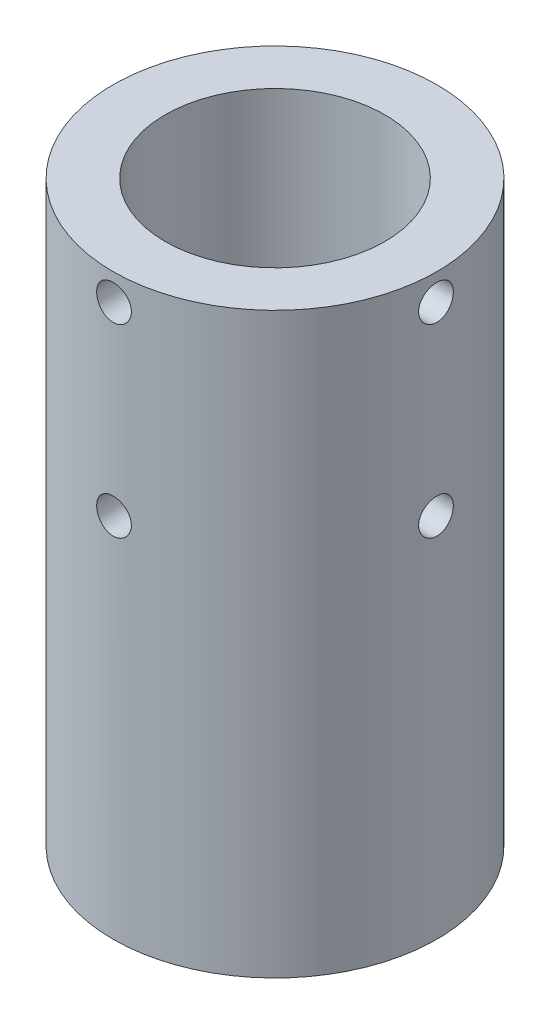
from build123d import *

# Parameters (mm, degrees)
SKETCH1_R               = 14
BOSS_EXTRUDE1_DEPTH     = 50
CUT_EXTRUDE1_DEPTH      = 33
SKETCH3_R               = 9.5
CUT_EXTRUDE2_DEPTH      = 24.5
CUT_EXTRUDE3_REACH      = 60.992
CUT_EXTRUDE3_END_RADIUS = 9.5
SKETCH5_R               = 1.5
CIRPATTERN1_COUNT       = 2
CIRPATTERN1_ANGLE       = 90


with BuildPart() as part:
    # Sketch1 → Boss-Extrude1 (new body)
    with BuildSketch(Plane(origin=(0, 0, 0), x_dir=(1, 0, 0), z_dir=(0, 1, 0))):
        with Locations(Location((0, 0, 0), (0, 0, 270))):
            Circle(SKETCH1_R)
    extrude(amount=BOSS_EXTRUDE1_DEPTH)

    # Sketch2 → Cut-Extrude1 (cut)
    with BuildSketch(Plane(origin=(0, 0, 0), x_dir=(-1, 0, 0), z_dir=(0, -1, 0))):
        with BuildLine():
            Line((-2.397915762, -5.5), (2.397915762, -5.5))
            ThreePointArc((2.397915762, -5.5), (5.196152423, -3), (5.962097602, 0.673344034))
            Line((5.962097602, 0.673344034), (3.56418184, 4.826655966))
            ThreePointArc((3.56418184, 4.826655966), (0, 6), (-3.56418184, 4.826655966))
            Line((-3.56418184, 4.826655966), (-5.962097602, 0.673344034))
            ThreePointArc((-5.962097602, 0.673344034), (-5.196152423, -3), (-2.397915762, -5.5))
        make_face()
    extrude(amount=-CUT_EXTRUDE1_DEPTH, mode=Mode.SUBTRACT)

    # Sketch3 → Cut-Extrude2 (cut)
    with BuildSketch(Plane(origin=(0, 50, 0), x_dir=(1, 0, 0), z_dir=(0, 1, 0))):
        with Locations(Location((0, 0, 0), (0, 0, 270))):
            Circle(SKETCH3_R)
    extrude(amount=-CUT_EXTRUDE2_DEPTH, mode=Mode.SUBTRACT)

    # Cut-Extrude3: up to this cylinder (the profile starts outside it)
    cut_extrude3_end = Plane(origin=(0, 39.7, 0), z_dir=(0, 1, 0)) * Cylinder(CUT_EXTRUDE3_END_RADIUS, 157.984, mode=Mode.PRIVATE)
    # Sketch5 → Cut-Extrude3 (cut, up to the surface)
    with BuildSketch(Plane(origin=(14, 50, 0), x_dir=(0, 0, -1), z_dir=(1, 0, 0)), mode=Mode.PRIVATE) as cut_extrude3_sk1:
        with Locations((0, -2.3)):
            Circle(SKETCH5_R)
    cut_extrude3_tool1 = extrude(cut_extrude3_sk1.sketch, amount=-CUT_EXTRUDE3_REACH, mode=Mode.PRIVATE) - cut_extrude3_end
    # Sketch5 → Cut-Extrude3 (cut, up to the surface)
    with BuildSketch(Plane(origin=(14, 50, 0), x_dir=(0, 0, -1), z_dir=(1, 0, 0)), mode=Mode.PRIVATE) as cut_extrude3_sk2:
        with Locations((0, -18.3)):
            Circle(SKETCH5_R)
    cut_extrude3_tool2 = extrude(cut_extrude3_sk2.sketch, amount=-CUT_EXTRUDE3_REACH, mode=Mode.PRIVATE) - cut_extrude3_end
    cut_extrude3 = cut_extrude3_tool1.solids().sort_by_distance((14, 47.7, 0))[0] + cut_extrude3_tool2.solids().sort_by_distance((14, 31.7, 0))[0]
    add(cut_extrude3, mode=Mode.SUBTRACT)

    # CirPattern1: Cut-Extrude3 ×2 about axis
    cirpattern1_axis = Axis((0, 33, 0), (0, -1, 0))
    for i in range(1, CIRPATTERN1_COUNT):
        add(cut_extrude3.rotate(cirpattern1_axis, i * CIRPATTERN1_ANGLE / (CIRPATTERN1_COUNT - 1)), mode=Mode.SUBTRACT)


solid = part.part
